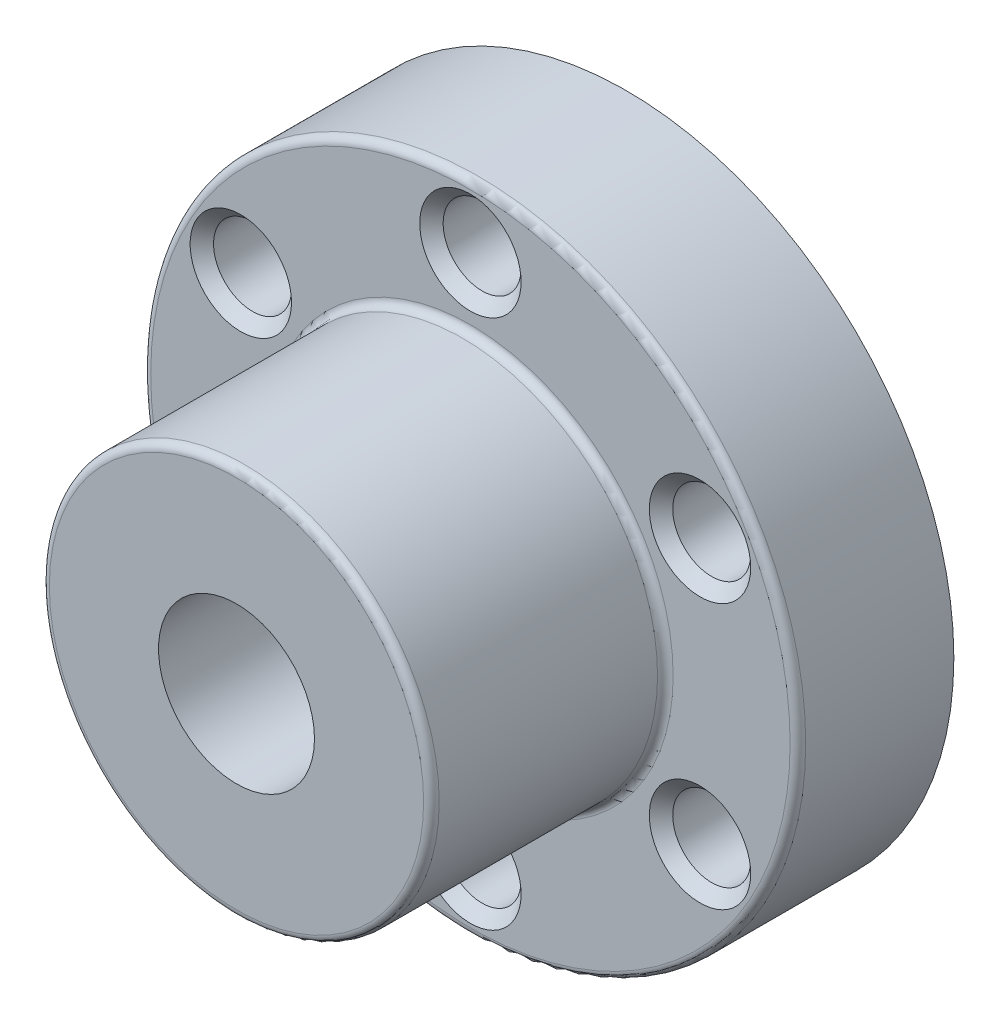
from build123d import *

# Parameters (mm, degrees)
SKETCH1_R                    = 21
BOSS_EXTRUDE1_DEPTH          = 10
SKETCH2_R                    = 12.5
BOSS_EXTRUDE2_DEPTH          = 15
SKETCH3_R                    = 5
CUT_EXTRUDE1_DEPTH           = 39.820097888
SKETCH4_R                    = 2.5
CUT_EXTRUDE2_DEPTH           = 39.820097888
FILLET1_R                    = 0.5
CHAMFER2_SIZE                = 0.75
CIRPATTERN2_COUNT            = 6
CHAMFER2_OF_CIRPATTERN2_SIZE = 0.75


with BuildPart() as part:
    # Sketch1 → Boss-Extrude1 (new body)
    with BuildSketch(Plane.XY):
        Circle(SKETCH1_R)
    extrude(amount=BOSS_EXTRUDE1_DEPTH)

    # Sketch2 → Boss-Extrude2 (add)
    with BuildSketch(Plane.XY.offset(10)):
        Circle(SKETCH2_R)
    extrude(amount=BOSS_EXTRUDE2_DEPTH)

    # Sketch3 → Cut-Extrude1 (cut, through all)
    with BuildSketch(Plane.XY.offset(25)):
        Circle(SKETCH3_R)
    extrude(amount=-CUT_EXTRUDE1_DEPTH, mode=Mode.SUBTRACT)

    # Sketch4 → Cut-Extrude2 (cut, through all)
    with BuildSketch(Plane(origin=(0, 0, 0), x_dir=(-1, 0, 0), z_dir=(0, 0, -1))):
        with Locations((0, 17)):
            Circle(SKETCH4_R)
    cut_extrude2 = extrude(amount=-CUT_EXTRUDE2_DEPTH, mode=Mode.SUBTRACT)

    # Fillet1
    fillet1_edges = [part.edges().sort_by_distance(p)[0] for p in [
        (-21, 0, 10),
        (-12.5, 0, 10),
        (-12.5, 0, 25),
    ]]
    fillet(fillet1_edges, radius=FILLET1_R)

    # Chamfer2
    chamfer2_edges = [part.edges().sort_by_distance(p)[0] for p in [
        (2.5, 17, 10),
    ]]
    chamfer(chamfer2_edges, length=CHAMFER2_SIZE)

    # CirPattern2: Cut-Extrude2 ×6 about axis
    cirpattern2_axis = Axis((0, 0, 0), (0, 0, 1))
    for i in range(1, CIRPATTERN2_COUNT):
        add(cut_extrude2.rotate(cirpattern2_axis, i * 360 / CIRPATTERN2_COUNT), mode=Mode.SUBTRACT)

    # Chamfer2 of CirPattern2
    chamfer2_of_cirpattern2_edges = [part.edges().sort_by_distance(p)[0] for p in [
        (-13.472431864, 10.665063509, 10),
        (-15.972431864, -6.334936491, 10),
        (-2.5, -17, 10),
        (13.472431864, -10.665063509, 10),
        (15.972431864, 6.334936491, 10),
    ]]
    chamfer(chamfer2_of_cirpattern2_edges, length=CHAMFER2_OF_CIRPATTERN2_SIZE)


solid = part.part
